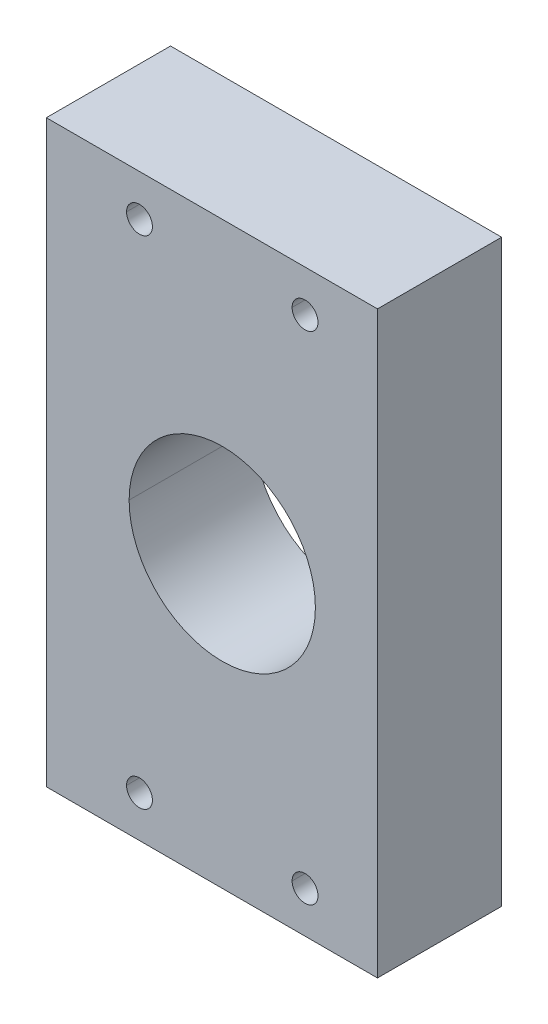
ISO-10303-21;
HEADER;
FILE_DESCRIPTION(('STEP AP214'),'2;1');
FILE_NAME('part.step','',(''),(''),'','','');
FILE_SCHEMA(('AUTOMOTIVE_DESIGN { 1 0 10303 214 1 1 1 1 }'));
ENDSEC;
DATA;
#1=APPLICATION_CONTEXT('core data for automotive mechanical design processes');
#2=APPLICATION_PROTOCOL_DEFINITION('international standard','automotive_design',2000,#1);
#3=PRODUCT_CONTEXT('',#1,'mechanical');
#4=PRODUCT('Part','Part','',(#3));
#5=PRODUCT_RELATED_PRODUCT_CATEGORY('part','',(#4));
#6=PRODUCT_DEFINITION_FORMATION('','',#4);
#7=PRODUCT_DEFINITION_CONTEXT('part definition',#1,'design');
#8=PRODUCT_DEFINITION('design','',#6,#7);
#9=PRODUCT_DEFINITION_SHAPE('','',#8);
#10=(LENGTH_UNIT() NAMED_UNIT(*) SI_UNIT(.MILLI.,.METRE.));
#11=(NAMED_UNIT(*) PLANE_ANGLE_UNIT() SI_UNIT($,.RADIAN.));
#12=(NAMED_UNIT(*) SI_UNIT($,.STERADIAN.) SOLID_ANGLE_UNIT());
#13=UNCERTAINTY_MEASURE_WITH_UNIT(LENGTH_MEASURE(1.E-05),#10,'distance_accuracy_value','');
#14=(GEOMETRIC_REPRESENTATION_CONTEXT(3) GLOBAL_UNCERTAINTY_ASSIGNED_CONTEXT((#13)) GLOBAL_UNIT_ASSIGNED_CONTEXT((#10,
#11,#12)) REPRESENTATION_CONTEXT('',''));
#15=CARTESIAN_POINT('',(0.,0.,0.));
#16=DIRECTION('',(0.,0.,1.));
#17=DIRECTION('',(1.,0.,0.));
#18=AXIS2_PLACEMENT_3D('',#15,#16,#17);
#19=CARTESIAN_POINT('',(-47.625,0.,19.05));
#20=DIRECTION('',(0.,0.,-1.));
#21=DIRECTION('',(-1.,0.,0.));
#22=AXIS2_PLACEMENT_3D('',#19,#20,#21);
#23=PLANE('',#22);
#24=DIRECTION('',(0.,1.,0.));
#25=VECTOR('',#24,1.);
#26=CARTESIAN_POINT('',(50.8,88.9,19.05));
#27=LINE('',#26,#25);
#28=CARTESIAN_POINT('',(50.8,88.9,19.05));
#29=VERTEX_POINT('',#28);
#30=CARTESIAN_POINT('',(50.8,-88.9,19.05));
#31=VERTEX_POINT('',#30);
#32=EDGE_CURVE('E261',#29,#31,#27,.F.);
#33=ORIENTED_EDGE('',*,*,#32,.F.);
#34=DIRECTION('',(1.,0.,0.));
#35=VECTOR('',#34,1.);
#36=CARTESIAN_POINT('',(-47.625,88.9,19.05));
#37=LINE('',#36,#35);
#38=CARTESIAN_POINT('',(-50.8,88.9,19.05));
#39=VERTEX_POINT('',#38);
#40=EDGE_CURVE('E161',#29,#39,#37,.F.);
#41=ORIENTED_EDGE('',*,*,#40,.T.);
#42=DIRECTION('',(0.,1.,0.));
#43=VECTOR('',#42,1.);
#44=CARTESIAN_POINT('',(-50.8,0.,19.05));
#45=LINE('',#44,#43);
#46=CARTESIAN_POINT('',(-50.8,-88.9,19.05));
#47=VERTEX_POINT('',#46);
#48=EDGE_CURVE('E287',#47,#39,#45,.T.);
#49=ORIENTED_EDGE('',*,*,#48,.F.);
#50=DIRECTION('',(1.,0.,0.));
#51=VECTOR('',#50,1.);
#52=CARTESIAN_POINT('',(-47.625,-88.9,19.05));
#53=LINE('',#52,#51);
#54=EDGE_CURVE('E292',#47,#31,#53,.T.);
#55=ORIENTED_EDGE('',*,*,#54,.T.);
#56=EDGE_LOOP('',(#33,#41,#49,#55));
#57=FACE_BOUND('',#56,.T.);
#58=CARTESIAN_POINT('',(28.5750000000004,-76.2,19.05));
#59=DIRECTION('',(0.,0.,1.));
#60=DIRECTION('',(1.,0.,0.));
#61=AXIS2_PLACEMENT_3D('',#58,#59,#60);
#62=CIRCLE('',#61,3.96875);
#63=CARTESIAN_POINT('',(32.5437500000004,-76.2,19.05));
#64=VERTEX_POINT('',#63);
#65=CARTESIAN_POINT('',(24.6062500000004,-76.2,19.05));
#66=VERTEX_POINT('',#65);
#67=EDGE_CURVE('E167',#64,#66,#62,.F.);
#68=ORIENTED_EDGE('',*,*,#67,.T.);
#69=CARTESIAN_POINT('',(28.5750000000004,-76.2,19.05));
#70=DIRECTION('',(0.,0.,1.));
#71=DIRECTION('',(1.,0.,0.));
#72=AXIS2_PLACEMENT_3D('',#69,#70,#71);
#73=CIRCLE('',#72,3.96875);
#74=EDGE_CURVE('E162',#66,#64,#73,.F.);
#75=ORIENTED_EDGE('',*,*,#74,.T.);
#76=EDGE_LOOP('',(#68,#75));
#77=FACE_BOUND('',#76,.T.);
#78=CARTESIAN_POINT('',(-22.2249999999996,-76.2,19.05));
#79=DIRECTION('',(0.,0.,1.));
#80=DIRECTION('',(1.,0.,0.));
#81=AXIS2_PLACEMENT_3D('',#78,#79,#80);
#82=CIRCLE('',#81,3.96875);
#83=CARTESIAN_POINT('',(-18.2562499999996,-76.2,19.05));
#84=VERTEX_POINT('',#83);
#85=CARTESIAN_POINT('',(-26.1937499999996,-76.2,19.05));
#86=VERTEX_POINT('',#85);
#87=EDGE_CURVE('E174',#84,#86,#82,.F.);
#88=ORIENTED_EDGE('',*,*,#87,.T.);
#89=CARTESIAN_POINT('',(-22.2249999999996,-76.2,19.05));
#90=DIRECTION('',(0.,0.,1.));
#91=DIRECTION('',(1.,0.,0.));
#92=AXIS2_PLACEMENT_3D('',#89,#90,#91);
#93=CIRCLE('',#92,3.96875);
#94=EDGE_CURVE('E170',#86,#84,#93,.F.);
#95=ORIENTED_EDGE('',*,*,#94,.T.);
#96=EDGE_LOOP('',(#88,#95));
#97=FACE_BOUND('',#96,.T.);
#98=CARTESIAN_POINT('',(28.5750000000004,76.2,19.05));
#99=DIRECTION('',(0.,0.,1.));
#100=DIRECTION('',(1.,0.,0.));
#101=AXIS2_PLACEMENT_3D('',#98,#99,#100);
#102=CIRCLE('',#101,3.96875);
#103=CARTESIAN_POINT('',(32.5437500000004,76.2,19.05));
#104=VERTEX_POINT('',#103);
#105=CARTESIAN_POINT('',(24.6062500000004,76.2,19.05));
#106=VERTEX_POINT('',#105);
#107=EDGE_CURVE('E181',#104,#106,#102,.F.);
#108=ORIENTED_EDGE('',*,*,#107,.T.);
#109=CARTESIAN_POINT('',(28.5750000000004,76.2,19.05));
#110=DIRECTION('',(0.,0.,1.));
#111=DIRECTION('',(1.,0.,0.));
#112=AXIS2_PLACEMENT_3D('',#109,#110,#111);
#113=CIRCLE('',#112,3.96875);
#114=EDGE_CURVE('E177',#106,#104,#113,.F.);
#115=ORIENTED_EDGE('',*,*,#114,.T.);
#116=EDGE_LOOP('',(#108,#115));
#117=FACE_BOUND('',#116,.T.);
#118=CARTESIAN_POINT('',(-22.2249999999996,76.2,19.05));
#119=DIRECTION('',(0.,0.,1.));
#120=DIRECTION('',(1.,0.,0.));
#121=AXIS2_PLACEMENT_3D('',#118,#119,#120);
#122=CIRCLE('',#121,3.96875);
#123=CARTESIAN_POINT('',(-18.2562499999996,76.2,19.05));
#124=VERTEX_POINT('',#123);
#125=CARTESIAN_POINT('',(-26.1937499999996,76.2,19.05));
#126=VERTEX_POINT('',#125);
#127=EDGE_CURVE('E188',#124,#126,#122,.F.);
#128=ORIENTED_EDGE('',*,*,#127,.T.);
#129=CARTESIAN_POINT('',(-22.2249999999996,76.2,19.05));
#130=DIRECTION('',(0.,0.,1.));
#131=DIRECTION('',(1.,0.,0.));
#132=AXIS2_PLACEMENT_3D('',#129,#130,#131);
#133=CIRCLE('',#132,3.96875);
#134=EDGE_CURVE('E184',#126,#124,#133,.F.);
#135=ORIENTED_EDGE('',*,*,#134,.T.);
#136=EDGE_LOOP('',(#128,#135));
#137=FACE_BOUND('',#136,.T.);
#138=CARTESIAN_POINT('',(3.17500000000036,0.,19.05));
#139=DIRECTION('',(0.,0.,1.));
#140=DIRECTION('',(1.,0.,0.));
#141=AXIS2_PLACEMENT_3D('',#138,#139,#140);
#142=CIRCLE('',#141,28.575);
#143=CARTESIAN_POINT('',(31.7500000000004,0.,19.05));
#144=VERTEX_POINT('',#143);
#145=CARTESIAN_POINT('',(-25.3999999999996,-1.67813651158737E-13,19.05));
#146=VERTEX_POINT('',#145);
#147=EDGE_CURVE('E19',#144,#146,#142,.F.);
#148=ORIENTED_EDGE('',*,*,#147,.T.);
#149=CARTESIAN_POINT('',(3.17500000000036,0.,19.05));
#150=DIRECTION('',(0.,0.,1.));
#151=DIRECTION('',(1.,0.,0.));
#152=AXIS2_PLACEMENT_3D('',#149,#150,#151);
#153=CIRCLE('',#152,28.575);
#154=EDGE_CURVE('E119',#146,#144,#153,.F.);
#155=ORIENTED_EDGE('',*,*,#154,.T.);
#156=EDGE_LOOP('',(#148,#155));
#157=FACE_BOUND('',#156,.T.);
#158=ADVANCED_FACE('F16',(#57,#77,#97,#117,#137,#157),#23,.F.);
#159=CARTESIAN_POINT('',(3.17500000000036,0.,-15.3034999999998));
#160=DIRECTION('',(0.,0.,1.));
#161=DIRECTION('',(1.,0.,0.));
#162=AXIS2_PLACEMENT_3D('',#159,#160,#161);
#163=CYLINDRICAL_SURFACE('',#162,28.575);
#164=CARTESIAN_POINT('',(3.17500000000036,0.,-19.05));
#165=DIRECTION('',(0.,0.,1.));
#166=DIRECTION('',(1.,0.,0.));
#167=AXIS2_PLACEMENT_3D('',#164,#165,#166);
#168=CIRCLE('',#167,28.575);
#169=CARTESIAN_POINT('',(31.7500000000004,0.,-19.05));
#170=VERTEX_POINT('',#169);
#171=CARTESIAN_POINT('',(-25.3999999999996,-1.67813651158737E-13,-19.05));
#172=VERTEX_POINT('',#171);
#173=EDGE_CURVE('E128',#170,#172,#168,.F.);
#174=ORIENTED_EDGE('',*,*,#173,.T.);
#175=DIRECTION('',(0.,0.,1.));
#176=VECTOR('',#175,1.);
#177=CARTESIAN_POINT('',(-25.3999999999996,-1.7415857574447E-13,-15.3034999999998));
#178=LINE('',#177,#176);
#179=EDGE_CURVE('E120',#172,#146,#178,.T.);
#180=ORIENTED_EDGE('',*,*,#179,.T.);
#181=ORIENTED_EDGE('',*,*,#147,.F.);
#182=DIRECTION('',(0.,0.,1.));
#183=VECTOR('',#182,1.);
#184=CARTESIAN_POINT('',(31.7500000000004,0.,-15.3034999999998));
#185=LINE('',#184,#183);
#186=EDGE_CURVE('E125',#144,#170,#185,.F.);
#187=ORIENTED_EDGE('',*,*,#186,.T.);
#188=EDGE_LOOP('',(#174,#180,#181,#187));
#189=FACE_BOUND('',#188,.T.);
#190=ADVANCED_FACE('F127',(#189),#163,.F.);
#191=CARTESIAN_POINT('',(3.17500000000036,0.,-15.3034999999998));
#192=DIRECTION('',(0.,0.,1.));
#193=DIRECTION('',(1.,0.,0.));
#194=AXIS2_PLACEMENT_3D('',#191,#192,#193);
#195=CYLINDRICAL_SURFACE('',#194,28.575);
#196=ORIENTED_EDGE('',*,*,#154,.F.);
#197=ORIENTED_EDGE('',*,*,#179,.F.);
#198=CARTESIAN_POINT('',(3.17500000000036,0.,-19.05));
#199=DIRECTION('',(0.,0.,1.));
#200=DIRECTION('',(1.,0.,0.));
#201=AXIS2_PLACEMENT_3D('',#198,#199,#200);
#202=CIRCLE('',#201,28.575);
#203=EDGE_CURVE('E158',#172,#170,#202,.F.);
#204=ORIENTED_EDGE('',*,*,#203,.T.);
#205=ORIENTED_EDGE('',*,*,#186,.F.);
#206=EDGE_LOOP('',(#196,#197,#204,#205));
#207=FACE_BOUND('',#206,.T.);
#208=ADVANCED_FACE('F122',(#207),#195,.F.);
#209=CARTESIAN_POINT('',(-22.2249999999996,76.2,-6.35));
#210=DIRECTION('',(0.,0.,1.));
#211=DIRECTION('',(1.,0.,0.));
#212=AXIS2_PLACEMENT_3D('',#209,#210,#211);
#213=CYLINDRICAL_SURFACE('',#212,3.96875);
#214=CARTESIAN_POINT('',(-22.2249999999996,76.2,-19.05));
#215=DIRECTION('',(0.,0.,1.));
#216=DIRECTION('',(1.,0.,0.));
#217=AXIS2_PLACEMENT_3D('',#214,#215,#216);
#218=CIRCLE('',#217,3.96875);
#219=CARTESIAN_POINT('',(-18.2562499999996,76.2,-19.05));
#220=VERTEX_POINT('',#219);
#221=CARTESIAN_POINT('',(-26.1937499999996,76.2,-19.05));
#222=VERTEX_POINT('',#221);
#223=EDGE_CURVE('E155',#220,#222,#218,.F.);
#224=ORIENTED_EDGE('',*,*,#223,.T.);
#225=DIRECTION('',(0.,0.,1.));
#226=VECTOR('',#225,1.);
#227=CARTESIAN_POINT('',(-26.1937499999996,76.2,-6.35));
#228=LINE('',#227,#226);
#229=EDGE_CURVE('E187',#222,#126,#228,.T.);
#230=ORIENTED_EDGE('',*,*,#229,.T.);
#231=ORIENTED_EDGE('',*,*,#127,.F.);
#232=DIRECTION('',(0.,0.,1.));
#233=VECTOR('',#232,1.);
#234=CARTESIAN_POINT('',(-18.2562499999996,76.2,-6.35));
#235=LINE('',#234,#233);
#236=EDGE_CURVE('E183',#124,#220,#235,.F.);
#237=ORIENTED_EDGE('',*,*,#236,.T.);
#238=EDGE_LOOP('',(#224,#230,#231,#237));
#239=FACE_BOUND('',#238,.T.);
#240=ADVANCED_FACE('F245',(#239),#213,.F.);
#241=CARTESIAN_POINT('',(-22.2249999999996,76.2,-6.35));
#242=DIRECTION('',(0.,0.,1.));
#243=DIRECTION('',(1.,0.,0.));
#244=AXIS2_PLACEMENT_3D('',#241,#242,#243);
#245=CYLINDRICAL_SURFACE('',#244,3.96875);
#246=ORIENTED_EDGE('',*,*,#134,.F.);
#247=ORIENTED_EDGE('',*,*,#229,.F.);
#248=CARTESIAN_POINT('',(-22.2249999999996,76.2,-19.05));
#249=DIRECTION('',(0.,0.,1.));
#250=DIRECTION('',(1.,0.,0.));
#251=AXIS2_PLACEMENT_3D('',#248,#249,#250);
#252=CIRCLE('',#251,3.96875);
#253=EDGE_CURVE('E152',#222,#220,#252,.F.);
#254=ORIENTED_EDGE('',*,*,#253,.T.);
#255=ORIENTED_EDGE('',*,*,#236,.F.);
#256=EDGE_LOOP('',(#246,#247,#254,#255));
#257=FACE_BOUND('',#256,.T.);
#258=ADVANCED_FACE('F241',(#257),#245,.F.);
#259=CARTESIAN_POINT('',(28.5750000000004,76.2,-6.35));
#260=DIRECTION('',(0.,0.,1.));
#261=DIRECTION('',(1.,0.,0.));
#262=AXIS2_PLACEMENT_3D('',#259,#260,#261);
#263=CYLINDRICAL_SURFACE('',#262,3.96875);
#264=CARTESIAN_POINT('',(28.5750000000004,76.2,-19.05));
#265=DIRECTION('',(0.,0.,1.));
#266=DIRECTION('',(1.,0.,0.));
#267=AXIS2_PLACEMENT_3D('',#264,#265,#266);
#268=CIRCLE('',#267,3.96875);
#269=CARTESIAN_POINT('',(32.5437500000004,76.2,-19.05));
#270=VERTEX_POINT('',#269);
#271=CARTESIAN_POINT('',(24.6062500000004,76.2,-19.05));
#272=VERTEX_POINT('',#271);
#273=EDGE_CURVE('E149',#270,#272,#268,.F.);
#274=ORIENTED_EDGE('',*,*,#273,.T.);
#275=DIRECTION('',(0.,0.,1.));
#276=VECTOR('',#275,1.);
#277=CARTESIAN_POINT('',(24.6062500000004,76.2,-6.35));
#278=LINE('',#277,#276);
#279=EDGE_CURVE('E180',#272,#106,#278,.T.);
#280=ORIENTED_EDGE('',*,*,#279,.T.);
#281=ORIENTED_EDGE('',*,*,#107,.F.);
#282=DIRECTION('',(0.,0.,1.));
#283=VECTOR('',#282,1.);
#284=CARTESIAN_POINT('',(32.5437500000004,76.2,-6.35));
#285=LINE('',#284,#283);
#286=EDGE_CURVE('E176',#104,#270,#285,.F.);
#287=ORIENTED_EDGE('',*,*,#286,.T.);
#288=EDGE_LOOP('',(#274,#280,#281,#287));
#289=FACE_BOUND('',#288,.T.);
#290=ADVANCED_FACE('F237',(#289),#263,.F.);
#291=CARTESIAN_POINT('',(28.5750000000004,76.2,-6.35));
#292=DIRECTION('',(0.,0.,1.));
#293=DIRECTION('',(1.,0.,0.));
#294=AXIS2_PLACEMENT_3D('',#291,#292,#293);
#295=CYLINDRICAL_SURFACE('',#294,3.96875);
#296=ORIENTED_EDGE('',*,*,#114,.F.);
#297=ORIENTED_EDGE('',*,*,#279,.F.);
#298=CARTESIAN_POINT('',(28.5750000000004,76.2,-19.05));
#299=DIRECTION('',(0.,0.,1.));
#300=DIRECTION('',(1.,0.,0.));
#301=AXIS2_PLACEMENT_3D('',#298,#299,#300);
#302=CIRCLE('',#301,3.96875);
#303=EDGE_CURVE('E146',#272,#270,#302,.F.);
#304=ORIENTED_EDGE('',*,*,#303,.T.);
#305=ORIENTED_EDGE('',*,*,#286,.F.);
#306=EDGE_LOOP('',(#296,#297,#304,#305));
#307=FACE_BOUND('',#306,.T.);
#308=ADVANCED_FACE('F233',(#307),#295,.F.);
#309=CARTESIAN_POINT('',(-22.2249999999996,-76.2,-6.35));
#310=DIRECTION('',(0.,0.,1.));
#311=DIRECTION('',(1.,0.,0.));
#312=AXIS2_PLACEMENT_3D('',#309,#310,#311);
#313=CYLINDRICAL_SURFACE('',#312,3.96875);
#314=CARTESIAN_POINT('',(-22.2249999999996,-76.2,-19.05));
#315=DIRECTION('',(0.,0.,1.));
#316=DIRECTION('',(1.,0.,0.));
#317=AXIS2_PLACEMENT_3D('',#314,#315,#316);
#318=CIRCLE('',#317,3.96875);
#319=CARTESIAN_POINT('',(-18.2562499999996,-76.2,-19.05));
#320=VERTEX_POINT('',#319);
#321=CARTESIAN_POINT('',(-26.1937499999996,-76.2,-19.05));
#322=VERTEX_POINT('',#321);
#323=EDGE_CURVE('E143',#320,#322,#318,.F.);
#324=ORIENTED_EDGE('',*,*,#323,.T.);
#325=DIRECTION('',(0.,0.,1.));
#326=VECTOR('',#325,1.);
#327=CARTESIAN_POINT('',(-26.1937499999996,-76.2,-6.35));
#328=LINE('',#327,#326);
#329=EDGE_CURVE('E173',#322,#86,#328,.T.);
#330=ORIENTED_EDGE('',*,*,#329,.T.);
#331=ORIENTED_EDGE('',*,*,#87,.F.);
#332=DIRECTION('',(0.,0.,1.));
#333=VECTOR('',#332,1.);
#334=CARTESIAN_POINT('',(-18.2562499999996,-76.2,-6.35));
#335=LINE('',#334,#333);
#336=EDGE_CURVE('E169',#84,#320,#335,.F.);
#337=ORIENTED_EDGE('',*,*,#336,.T.);
#338=EDGE_LOOP('',(#324,#330,#331,#337));
#339=FACE_BOUND('',#338,.T.);
#340=ADVANCED_FACE('F229',(#339),#313,.F.);
#341=CARTESIAN_POINT('',(-22.2249999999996,-76.2,-6.35));
#342=DIRECTION('',(0.,0.,1.));
#343=DIRECTION('',(1.,0.,0.));
#344=AXIS2_PLACEMENT_3D('',#341,#342,#343);
#345=CYLINDRICAL_SURFACE('',#344,3.96875);
#346=ORIENTED_EDGE('',*,*,#94,.F.);
#347=ORIENTED_EDGE('',*,*,#329,.F.);
#348=CARTESIAN_POINT('',(-22.2249999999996,-76.2,-19.05));
#349=DIRECTION('',(0.,0.,1.));
#350=DIRECTION('',(1.,0.,0.));
#351=AXIS2_PLACEMENT_3D('',#348,#349,#350);
#352=CIRCLE('',#351,3.96875);
#353=EDGE_CURVE('E140',#322,#320,#352,.F.);
#354=ORIENTED_EDGE('',*,*,#353,.T.);
#355=ORIENTED_EDGE('',*,*,#336,.F.);
#356=EDGE_LOOP('',(#346,#347,#354,#355));
#357=FACE_BOUND('',#356,.T.);
#358=ADVANCED_FACE('F225',(#357),#345,.F.);
#359=CARTESIAN_POINT('',(28.5750000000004,-76.2,-6.35));
#360=DIRECTION('',(0.,0.,1.));
#361=DIRECTION('',(1.,0.,0.));
#362=AXIS2_PLACEMENT_3D('',#359,#360,#361);
#363=CYLINDRICAL_SURFACE('',#362,3.96875);
#364=CARTESIAN_POINT('',(28.5750000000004,-76.2,-19.05));
#365=DIRECTION('',(0.,0.,1.));
#366=DIRECTION('',(1.,0.,0.));
#367=AXIS2_PLACEMENT_3D('',#364,#365,#366);
#368=CIRCLE('',#367,3.96875);
#369=CARTESIAN_POINT('',(32.5437500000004,-76.2,-19.05));
#370=VERTEX_POINT('',#369);
#371=CARTESIAN_POINT('',(24.6062500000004,-76.2,-19.05));
#372=VERTEX_POINT('',#371);
#373=EDGE_CURVE('E137',#370,#372,#368,.F.);
#374=ORIENTED_EDGE('',*,*,#373,.T.);
#375=DIRECTION('',(0.,0.,1.));
#376=VECTOR('',#375,1.);
#377=CARTESIAN_POINT('',(24.6062500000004,-76.2,-6.35));
#378=LINE('',#377,#376);
#379=EDGE_CURVE('E166',#372,#66,#378,.T.);
#380=ORIENTED_EDGE('',*,*,#379,.T.);
#381=ORIENTED_EDGE('',*,*,#67,.F.);
#382=DIRECTION('',(0.,0.,1.));
#383=VECTOR('',#382,1.);
#384=CARTESIAN_POINT('',(32.5437500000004,-76.2,-6.35));
#385=LINE('',#384,#383);
#386=EDGE_CURVE('E165',#64,#370,#385,.F.);
#387=ORIENTED_EDGE('',*,*,#386,.T.);
#388=EDGE_LOOP('',(#374,#380,#381,#387));
#389=FACE_BOUND('',#388,.T.);
#390=ADVANCED_FACE('F221',(#389),#363,.F.);
#391=CARTESIAN_POINT('',(28.5750000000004,-76.2,-6.35));
#392=DIRECTION('',(0.,0.,1.));
#393=DIRECTION('',(1.,0.,0.));
#394=AXIS2_PLACEMENT_3D('',#391,#392,#393);
#395=CYLINDRICAL_SURFACE('',#394,3.96875);
#396=ORIENTED_EDGE('',*,*,#74,.F.);
#397=ORIENTED_EDGE('',*,*,#379,.F.);
#398=CARTESIAN_POINT('',(28.5750000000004,-76.2,-19.05));
#399=DIRECTION('',(0.,0.,1.));
#400=DIRECTION('',(1.,0.,0.));
#401=AXIS2_PLACEMENT_3D('',#398,#399,#400);
#402=CIRCLE('',#401,3.96875);
#403=EDGE_CURVE('E133',#372,#370,#402,.F.);
#404=ORIENTED_EDGE('',*,*,#403,.T.);
#405=ORIENTED_EDGE('',*,*,#386,.F.);
#406=EDGE_LOOP('',(#396,#397,#404,#405));
#407=FACE_BOUND('',#406,.T.);
#408=ADVANCED_FACE('F217',(#407),#395,.F.);
#409=CARTESIAN_POINT('',(-50.8,0.,0.));
#410=DIRECTION('',(-1.,0.,0.));
#411=DIRECTION('',(0.,0.,1.));
#412=AXIS2_PLACEMENT_3D('',#409,#410,#411);
#413=PLANE('',#412);
#414=DIRECTION('',(0.,0.,-1.));
#415=VECTOR('',#414,1.);
#416=CARTESIAN_POINT('',(-50.8,88.9,0.));
#417=LINE('',#416,#415);
#418=CARTESIAN_POINT('',(-50.8,88.9,-19.05));
#419=VERTEX_POINT('',#418);
#420=EDGE_CURVE('E297',#39,#419,#417,.T.);
#421=ORIENTED_EDGE('',*,*,#420,.T.);
#422=DIRECTION('',(0.,1.,0.));
#423=VECTOR('',#422,1.);
#424=CARTESIAN_POINT('',(-50.8,0.,-19.05));
#425=LINE('',#424,#423);
#426=CARTESIAN_POINT('',(-50.8,-88.9,-19.05));
#427=VERTEX_POINT('',#426);
#428=EDGE_CURVE('E136',#419,#427,#425,.F.);
#429=ORIENTED_EDGE('',*,*,#428,.T.);
#430=DIRECTION('',(0.,0.,1.));
#431=VECTOR('',#430,1.);
#432=CARTESIAN_POINT('',(-50.8,-88.9,0.));
#433=LINE('',#432,#431);
#434=EDGE_CURVE('E289',#427,#47,#433,.T.);
#435=ORIENTED_EDGE('',*,*,#434,.T.);
#436=ORIENTED_EDGE('',*,*,#48,.T.);
#437=EDGE_LOOP('',(#421,#429,#435,#436));
#438=FACE_BOUND('',#437,.T.);
#439=ADVANCED_FACE('F213',(#438),#413,.T.);
#440=CARTESIAN_POINT('',(-47.625,-88.9,0.));
#441=DIRECTION('',(0.,1.,0.));
#442=DIRECTION('',(0.,0.,1.));
#443=AXIS2_PLACEMENT_3D('',#440,#441,#442);
#444=PLANE('',#443);
#445=DIRECTION('',(0.,0.,-1.));
#446=VECTOR('',#445,1.);
#447=CARTESIAN_POINT('',(50.8,-88.9,-28.0034999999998));
#448=LINE('',#447,#446);
#449=CARTESIAN_POINT('',(50.8,-88.9,-19.05));
#450=VERTEX_POINT('',#449);
#451=EDGE_CURVE('E294',#31,#450,#448,.T.);
#452=ORIENTED_EDGE('',*,*,#451,.F.);
#453=ORIENTED_EDGE('',*,*,#54,.F.);
#454=ORIENTED_EDGE('',*,*,#434,.F.);
#455=DIRECTION('',(1.,0.,0.));
#456=VECTOR('',#455,1.);
#457=CARTESIAN_POINT('',(-47.625,-88.9,-19.05));
#458=LINE('',#457,#456);
#459=EDGE_CURVE('E304',#427,#450,#458,.T.);
#460=ORIENTED_EDGE('',*,*,#459,.T.);
#461=EDGE_LOOP('',(#452,#453,#454,#460));
#462=FACE_BOUND('',#461,.T.);
#463=ADVANCED_FACE('F209',(#462),#444,.F.);
#464=CARTESIAN_POINT('',(50.8,88.9,-28.0034999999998));
#465=DIRECTION('',(1.,0.,0.));
#466=DIRECTION('',(0.,0.,-1.));
#467=AXIS2_PLACEMENT_3D('',#464,#465,#466);
#468=PLANE('',#467);
#469=DIRECTION('',(0.,0.,-1.));
#470=VECTOR('',#469,1.);
#471=CARTESIAN_POINT('',(50.8,88.9,0.));
#472=LINE('',#471,#470);
#473=CARTESIAN_POINT('',(50.8,88.9,-19.05));
#474=VERTEX_POINT('',#473);
#475=EDGE_CURVE('E33',#474,#29,#472,.F.);
#476=ORIENTED_EDGE('',*,*,#475,.T.);
#477=ORIENTED_EDGE('',*,*,#32,.T.);
#478=ORIENTED_EDGE('',*,*,#451,.T.);
#479=DIRECTION('',(0.,1.,0.));
#480=VECTOR('',#479,1.);
#481=CARTESIAN_POINT('',(50.8,0.,-19.05));
#482=LINE('',#481,#480);
#483=EDGE_CURVE('E25',#450,#474,#482,.T.);
#484=ORIENTED_EDGE('',*,*,#483,.T.);
#485=EDGE_LOOP('',(#476,#477,#478,#484));
#486=FACE_BOUND('',#485,.T.);
#487=ADVANCED_FACE('F202',(#486),#468,.T.);
#488=CARTESIAN_POINT('',(-47.625,88.9,0.));
#489=DIRECTION('',(0.,-1.,0.));
#490=DIRECTION('',(0.,0.,-1.));
#491=AXIS2_PLACEMENT_3D('',#488,#489,#490);
#492=PLANE('',#491);
#493=ORIENTED_EDGE('',*,*,#475,.F.);
#494=DIRECTION('',(1.,0.,0.));
#495=VECTOR('',#494,1.);
#496=CARTESIAN_POINT('',(-47.625,88.9,-19.05));
#497=LINE('',#496,#495);
#498=EDGE_CURVE('E11',#474,#419,#497,.F.);
#499=ORIENTED_EDGE('',*,*,#498,.T.);
#500=ORIENTED_EDGE('',*,*,#420,.F.);
#501=ORIENTED_EDGE('',*,*,#40,.F.);
#502=EDGE_LOOP('',(#493,#499,#500,#501));
#503=FACE_BOUND('',#502,.T.);
#504=ADVANCED_FACE('F195',(#503),#492,.F.);
#505=CARTESIAN_POINT('',(-47.625,0.,-19.05));
#506=DIRECTION('',(0.,0.,1.));
#507=DIRECTION('',(1.,0.,0.));
#508=AXIS2_PLACEMENT_3D('',#505,#506,#507);
#509=PLANE('',#508);
#510=ORIENTED_EDGE('',*,*,#483,.F.);
#511=ORIENTED_EDGE('',*,*,#459,.F.);
#512=ORIENTED_EDGE('',*,*,#428,.F.);
#513=ORIENTED_EDGE('',*,*,#498,.F.);
#514=EDGE_LOOP('',(#510,#511,#512,#513));
#515=FACE_BOUND('',#514,.T.);
#516=ORIENTED_EDGE('',*,*,#373,.F.);
#517=ORIENTED_EDGE('',*,*,#403,.F.);
#518=EDGE_LOOP('',(#516,#517));
#519=FACE_BOUND('',#518,.T.);
#520=ORIENTED_EDGE('',*,*,#323,.F.);
#521=ORIENTED_EDGE('',*,*,#353,.F.);
#522=EDGE_LOOP('',(#520,#521));
#523=FACE_BOUND('',#522,.T.);
#524=ORIENTED_EDGE('',*,*,#273,.F.);
#525=ORIENTED_EDGE('',*,*,#303,.F.);
#526=EDGE_LOOP('',(#524,#525));
#527=FACE_BOUND('',#526,.T.);
#528=ORIENTED_EDGE('',*,*,#223,.F.);
#529=ORIENTED_EDGE('',*,*,#253,.F.);
#530=EDGE_LOOP('',(#528,#529));
#531=FACE_BOUND('',#530,.T.);
#532=ORIENTED_EDGE('',*,*,#173,.F.);
#533=ORIENTED_EDGE('',*,*,#203,.F.);
#534=EDGE_LOOP('',(#532,#533));
#535=FACE_BOUND('',#534,.T.);
#536=ADVANCED_FACE('F193',(#515,#519,#523,#527,#531,#535),#509,.F.);
#537=CLOSED_SHELL('',(#158,#190,#208,#240,#258,#290,#308,#340,#358,#390,#408,#439,#463,#487,
#504,#536));
#538=MANIFOLD_SOLID_BREP('B1',#537);
#539=ADVANCED_BREP_SHAPE_REPRESENTATION('',(#18,#538),#14);
#540=SHAPE_DEFINITION_REPRESENTATION(#9,#539);
ENDSEC;
END-ISO-10303-21;
